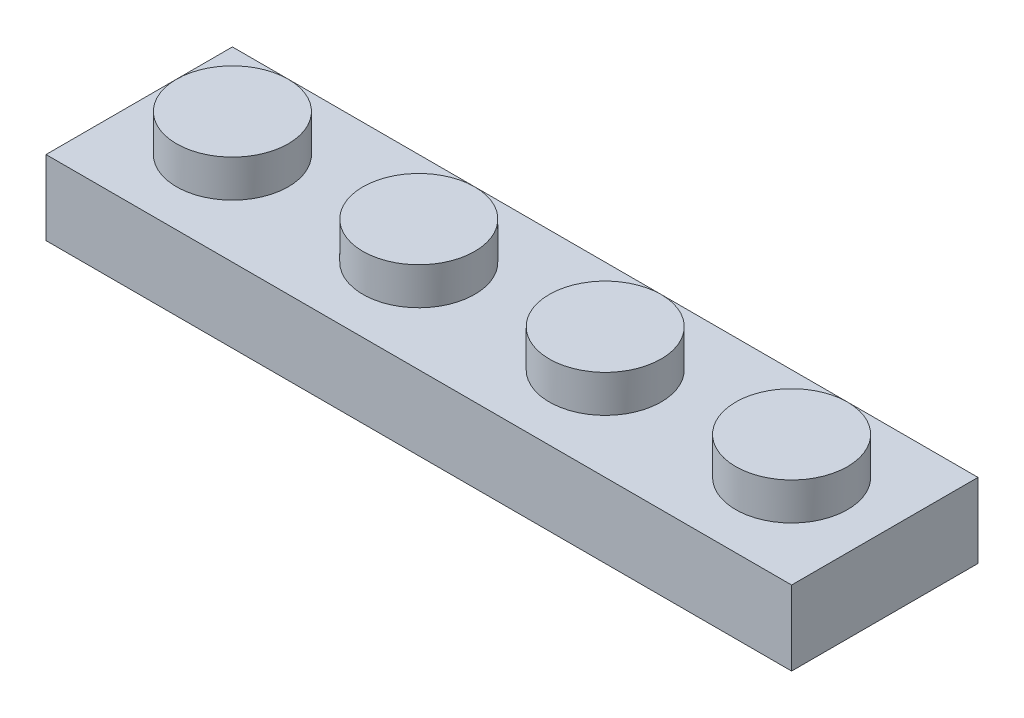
ISO-10303-21;
HEADER;
FILE_DESCRIPTION(('STEP AP214'),'2;1');
FILE_NAME('part.step','',(''),(''),'','','');
FILE_SCHEMA(('AUTOMOTIVE_DESIGN { 1 0 10303 214 1 1 1 1 }'));
ENDSEC;
DATA;
#1=APPLICATION_CONTEXT('core data for automotive mechanical design processes');
#2=APPLICATION_PROTOCOL_DEFINITION('international standard','automotive_design',2000,#1);
#3=PRODUCT_CONTEXT('',#1,'mechanical');
#4=PRODUCT('Part','Part','',(#3));
#5=PRODUCT_RELATED_PRODUCT_CATEGORY('part','',(#4));
#6=PRODUCT_DEFINITION_FORMATION('','',#4);
#7=PRODUCT_DEFINITION_CONTEXT('part definition',#1,'design');
#8=PRODUCT_DEFINITION('design','',#6,#7);
#9=PRODUCT_DEFINITION_SHAPE('','',#8);
#10=(LENGTH_UNIT() NAMED_UNIT(*) SI_UNIT(.MILLI.,.METRE.));
#11=(NAMED_UNIT(*) PLANE_ANGLE_UNIT() SI_UNIT($,.RADIAN.));
#12=(NAMED_UNIT(*) SI_UNIT($,.STERADIAN.) SOLID_ANGLE_UNIT());
#13=UNCERTAINTY_MEASURE_WITH_UNIT(LENGTH_MEASURE(1.E-05),#10,'distance_accuracy_value','');
#14=(GEOMETRIC_REPRESENTATION_CONTEXT(3) GLOBAL_UNCERTAINTY_ASSIGNED_CONTEXT((#13)) GLOBAL_UNIT_ASSIGNED_CONTEXT((#10,
#11,#12)) REPRESENTATION_CONTEXT('',''));
#15=CARTESIAN_POINT('',(0.,0.,0.));
#16=DIRECTION('',(0.,0.,1.));
#17=DIRECTION('',(1.,0.,0.));
#18=AXIS2_PLACEMENT_3D('',#15,#16,#17);
#19=CARTESIAN_POINT('',(0.,0.,0.));
#20=DIRECTION('',(0.,-1.,0.));
#21=DIRECTION('',(0.,0.,-1.));
#22=AXIS2_PLACEMENT_3D('',#19,#20,#21);
#23=PLANE('',#22);
#24=DIRECTION('',(0.,0.,-1.));
#25=VECTOR('',#24,1.);
#26=CARTESIAN_POINT('',(16.,0.,4.));
#27=LINE('',#26,#25);
#28=CARTESIAN_POINT('',(16.,0.,4.));
#29=VERTEX_POINT('',#28);
#30=CARTESIAN_POINT('',(16.,0.,-4.));
#31=VERTEX_POINT('',#30);
#32=EDGE_CURVE('E191',#29,#31,#27,.T.);
#33=ORIENTED_EDGE('',*,*,#32,.F.);
#34=DIRECTION('',(1.,0.,0.));
#35=VECTOR('',#34,1.);
#36=CARTESIAN_POINT('',(-16.,0.,4.));
#37=LINE('',#36,#35);
#38=CARTESIAN_POINT('',(-16.,0.,4.));
#39=VERTEX_POINT('',#38);
#40=EDGE_CURVE('E83',#39,#29,#37,.T.);
#41=ORIENTED_EDGE('',*,*,#40,.F.);
#42=DIRECTION('',(0.,0.,1.));
#43=VECTOR('',#42,1.);
#44=CARTESIAN_POINT('',(-16.,0.,4.));
#45=LINE('',#44,#43);
#46=CARTESIAN_POINT('',(-16.,0.,-4.));
#47=VERTEX_POINT('',#46);
#48=EDGE_CURVE('E203',#47,#39,#45,.T.);
#49=ORIENTED_EDGE('',*,*,#48,.F.);
#50=DIRECTION('',(-1.,0.,0.));
#51=VECTOR('',#50,1.);
#52=CARTESIAN_POINT('',(-16.,0.,-4.));
#53=LINE('',#52,#51);
#54=EDGE_CURVE('E201',#31,#47,#53,.T.);
#55=ORIENTED_EDGE('',*,*,#54,.F.);
#56=EDGE_LOOP('',(#33,#41,#49,#55));
#57=FACE_BOUND('',#56,.T.);
#58=DIRECTION('',(1.,0.,0.));
#59=VECTOR('',#58,1.);
#60=CARTESIAN_POINT('',(0.,0.,2.4));
#61=LINE('',#60,#59);
#62=CARTESIAN_POINT('',(-14.4,0.,2.4));
#63=VERTEX_POINT('',#62);
#64=CARTESIAN_POINT('',(14.4,0.,2.4));
#65=VERTEX_POINT('',#64);
#66=EDGE_CURVE('E131',#63,#65,#61,.T.);
#67=ORIENTED_EDGE('',*,*,#66,.T.);
#68=DIRECTION('',(0.,0.,-1.));
#69=VECTOR('',#68,1.);
#70=CARTESIAN_POINT('',(14.4,0.,0.));
#71=LINE('',#70,#69);
#72=CARTESIAN_POINT('',(14.4,0.,-2.4));
#73=VERTEX_POINT('',#72);
#74=EDGE_CURVE('E165',#65,#73,#71,.T.);
#75=ORIENTED_EDGE('',*,*,#74,.T.);
#76=DIRECTION('',(-1.,0.,0.));
#77=VECTOR('',#76,1.);
#78=CARTESIAN_POINT('',(0.,0.,-2.4));
#79=LINE('',#78,#77);
#80=CARTESIAN_POINT('',(-14.4,0.,-2.4));
#81=VERTEX_POINT('',#80);
#82=EDGE_CURVE('E135',#73,#81,#79,.T.);
#83=ORIENTED_EDGE('',*,*,#82,.T.);
#84=DIRECTION('',(0.,0.,1.));
#85=VECTOR('',#84,1.);
#86=CARTESIAN_POINT('',(-14.4,0.,0.));
#87=LINE('',#86,#85);
#88=EDGE_CURVE('E53',#81,#63,#87,.T.);
#89=ORIENTED_EDGE('',*,*,#88,.T.);
#90=EDGE_LOOP('',(#67,#75,#83,#89));
#91=FACE_BOUND('',#90,.T.);
#92=ADVANCED_FACE('F38',(#57,#91),#23,.T.);
#93=CARTESIAN_POINT('',(16.,3.2,4.));
#94=DIRECTION('',(-1.,0.,0.));
#95=DIRECTION('',(0.,0.,1.));
#96=AXIS2_PLACEMENT_3D('',#93,#94,#95);
#97=PLANE('',#96);
#98=ORIENTED_EDGE('',*,*,#32,.T.);
#99=DIRECTION('',(0.,-1.,0.));
#100=VECTOR('',#99,1.);
#101=CARTESIAN_POINT('',(16.,3.2,-4.));
#102=LINE('',#101,#100);
#103=CARTESIAN_POINT('',(16.,3.2,-4.));
#104=VERTEX_POINT('',#103);
#105=EDGE_CURVE('E212',#104,#31,#102,.T.);
#106=ORIENTED_EDGE('',*,*,#105,.F.);
#107=DIRECTION('',(0.,0.,-1.));
#108=VECTOR('',#107,1.);
#109=CARTESIAN_POINT('',(16.,3.2,4.));
#110=LINE('',#109,#108);
#111=CARTESIAN_POINT('',(16.,3.2,4.));
#112=VERTEX_POINT('',#111);
#113=EDGE_CURVE('E192',#112,#104,#110,.T.);
#114=ORIENTED_EDGE('',*,*,#113,.F.);
#115=DIRECTION('',(0.,-1.,0.));
#116=VECTOR('',#115,1.);
#117=CARTESIAN_POINT('',(16.,3.2,4.));
#118=LINE('',#117,#116);
#119=EDGE_CURVE('E198',#112,#29,#118,.T.);
#120=ORIENTED_EDGE('',*,*,#119,.T.);
#121=EDGE_LOOP('',(#98,#106,#114,#120));
#122=FACE_BOUND('',#121,.T.);
#123=ADVANCED_FACE('F40',(#122),#97,.F.);
#124=CARTESIAN_POINT('',(-16.,3.2,-4.));
#125=DIRECTION('',(0.,0.,1.));
#126=DIRECTION('',(1.,0.,0.));
#127=AXIS2_PLACEMENT_3D('',#124,#125,#126);
#128=PLANE('',#127);
#129=ORIENTED_EDGE('',*,*,#54,.T.);
#130=DIRECTION('',(0.,-1.,0.));
#131=VECTOR('',#130,1.);
#132=CARTESIAN_POINT('',(-16.,3.2,-4.));
#133=LINE('',#132,#131);
#134=CARTESIAN_POINT('',(-16.,3.2,-4.));
#135=VERTEX_POINT('',#134);
#136=EDGE_CURVE('E209',#135,#47,#133,.T.);
#137=ORIENTED_EDGE('',*,*,#136,.F.);
#138=DIRECTION('',(-1.,0.,0.));
#139=VECTOR('',#138,1.);
#140=CARTESIAN_POINT('',(-16.,3.2,-4.));
#141=LINE('',#140,#139);
#142=EDGE_CURVE('E91',#104,#135,#141,.T.);
#143=ORIENTED_EDGE('',*,*,#142,.F.);
#144=ORIENTED_EDGE('',*,*,#105,.T.);
#145=EDGE_LOOP('',(#129,#137,#143,#144));
#146=FACE_BOUND('',#145,.T.);
#147=ADVANCED_FACE('F238',(#146),#128,.F.);
#148=CARTESIAN_POINT('',(-16.,3.2,4.));
#149=DIRECTION('',(1.,0.,0.));
#150=DIRECTION('',(0.,0.,-1.));
#151=AXIS2_PLACEMENT_3D('',#148,#149,#150);
#152=PLANE('',#151);
#153=ORIENTED_EDGE('',*,*,#48,.T.);
#154=DIRECTION('',(0.,-1.,0.));
#155=VECTOR('',#154,1.);
#156=CARTESIAN_POINT('',(-16.,3.2,4.));
#157=LINE('',#156,#155);
#158=CARTESIAN_POINT('',(-16.,3.2,4.));
#159=VERTEX_POINT('',#158);
#160=EDGE_CURVE('E207',#159,#39,#157,.T.);
#161=ORIENTED_EDGE('',*,*,#160,.F.);
#162=DIRECTION('',(0.,0.,1.));
#163=VECTOR('',#162,1.);
#164=CARTESIAN_POINT('',(-16.,3.2,4.));
#165=LINE('',#164,#163);
#166=EDGE_CURVE('E195',#135,#159,#165,.T.);
#167=ORIENTED_EDGE('',*,*,#166,.F.);
#168=ORIENTED_EDGE('',*,*,#136,.T.);
#169=EDGE_LOOP('',(#153,#161,#167,#168));
#170=FACE_BOUND('',#169,.T.);
#171=ADVANCED_FACE('F243',(#170),#152,.F.);
#172=CARTESIAN_POINT('',(-16.,3.2,4.));
#173=DIRECTION('',(0.,0.,-1.));
#174=DIRECTION('',(-1.,0.,0.));
#175=AXIS2_PLACEMENT_3D('',#172,#173,#174);
#176=PLANE('',#175);
#177=ORIENTED_EDGE('',*,*,#40,.T.);
#178=ORIENTED_EDGE('',*,*,#119,.F.);
#179=DIRECTION('',(1.,0.,0.));
#180=VECTOR('',#179,1.);
#181=CARTESIAN_POINT('',(-16.,3.2,4.));
#182=LINE('',#181,#180);
#183=EDGE_CURVE('E62',#159,#112,#182,.T.);
#184=ORIENTED_EDGE('',*,*,#183,.F.);
#185=ORIENTED_EDGE('',*,*,#160,.T.);
#186=EDGE_LOOP('',(#177,#178,#184,#185));
#187=FACE_BOUND('',#186,.T.);
#188=ADVANCED_FACE('F228',(#187),#176,.F.);
#189=CARTESIAN_POINT('',(0.,3.2,0.));
#190=DIRECTION('',(0.,-1.,0.));
#191=DIRECTION('',(0.,0.,-1.));
#192=AXIS2_PLACEMENT_3D('',#189,#190,#191);
#193=PLANE('',#192);
#194=CARTESIAN_POINT('',(12.,3.2,0.));
#195=DIRECTION('',(0.,-1.,0.));
#196=DIRECTION('',(0.,0.,-1.));
#197=AXIS2_PLACEMENT_3D('',#194,#195,#196);
#198=CIRCLE('',#197,2.4);
#199=CARTESIAN_POINT('',(12.,3.2,-2.4));
#200=VERTEX_POINT('',#199);
#201=EDGE_CURVE('E11',#200,#200,#198,.F.);
#202=ORIENTED_EDGE('',*,*,#201,.F.);
#203=EDGE_LOOP('',(#202));
#204=FACE_BOUND('',#203,.T.);
#205=CARTESIAN_POINT('',(4.,3.2,0.));
#206=DIRECTION('',(0.,-1.,0.));
#207=DIRECTION('',(0.,0.,-1.));
#208=AXIS2_PLACEMENT_3D('',#205,#206,#207);
#209=CIRCLE('',#208,2.4);
#210=CARTESIAN_POINT('',(4.,3.2,-2.4));
#211=VERTEX_POINT('',#210);
#212=EDGE_CURVE('E46',#211,#211,#209,.F.);
#213=ORIENTED_EDGE('',*,*,#212,.F.);
#214=EDGE_LOOP('',(#213));
#215=FACE_BOUND('',#214,.T.);
#216=CARTESIAN_POINT('',(-4.,3.2,0.));
#217=DIRECTION('',(0.,-1.,0.));
#218=DIRECTION('',(0.,0.,-1.));
#219=AXIS2_PLACEMENT_3D('',#216,#217,#218);
#220=CIRCLE('',#219,2.4);
#221=CARTESIAN_POINT('',(-4.,3.2,-2.4));
#222=VERTEX_POINT('',#221);
#223=EDGE_CURVE('E217',#222,#222,#220,.F.);
#224=ORIENTED_EDGE('',*,*,#223,.F.);
#225=EDGE_LOOP('',(#224));
#226=FACE_BOUND('',#225,.T.);
#227=CARTESIAN_POINT('',(-12.,3.2,0.));
#228=DIRECTION('',(0.,-1.,0.));
#229=DIRECTION('',(0.,0.,-1.));
#230=AXIS2_PLACEMENT_3D('',#227,#228,#229);
#231=CIRCLE('',#230,2.4);
#232=CARTESIAN_POINT('',(-12.,3.2,-2.4));
#233=VERTEX_POINT('',#232);
#234=EDGE_CURVE('E214',#233,#233,#231,.F.);
#235=ORIENTED_EDGE('',*,*,#234,.F.);
#236=EDGE_LOOP('',(#235));
#237=FACE_BOUND('',#236,.T.);
#238=ORIENTED_EDGE('',*,*,#113,.T.);
#239=ORIENTED_EDGE('',*,*,#142,.T.);
#240=ORIENTED_EDGE('',*,*,#166,.T.);
#241=ORIENTED_EDGE('',*,*,#183,.T.);
#242=EDGE_LOOP('',(#238,#239,#240,#241));
#243=FACE_BOUND('',#242,.T.);
#244=ADVANCED_FACE('F224',(#204,#215,#226,#237,#243),#193,.F.);
#245=CARTESIAN_POINT('',(-12.,4.8,0.));
#246=DIRECTION('',(0.,-1.,0.));
#247=DIRECTION('',(0.,0.,-1.));
#248=AXIS2_PLACEMENT_3D('',#245,#246,#247);
#249=CYLINDRICAL_SURFACE('',#248,2.4);
#250=CARTESIAN_POINT('',(-12.,4.8,0.));
#251=DIRECTION('',(0.,1.,0.));
#252=DIRECTION('',(0.,0.,1.));
#253=AXIS2_PLACEMENT_3D('',#250,#251,#252);
#254=CIRCLE('',#253,2.4);
#255=CARTESIAN_POINT('',(-12.,4.8,2.4));
#256=VERTEX_POINT('',#255);
#257=EDGE_CURVE('E188',#256,#256,#254,.T.);
#258=ORIENTED_EDGE('',*,*,#257,.F.);
#259=EDGE_LOOP('',(#258));
#260=FACE_BOUND('',#259,.T.);
#261=ORIENTED_EDGE('',*,*,#234,.T.);
#262=EDGE_LOOP('',(#261));
#263=FACE_BOUND('',#262,.T.);
#264=ADVANCED_FACE('F227',(#260,#263),#249,.T.);
#265=CARTESIAN_POINT('',(-12.,4.8,0.));
#266=DIRECTION('',(0.,1.,0.));
#267=DIRECTION('',(0.,0.,1.));
#268=AXIS2_PLACEMENT_3D('',#265,#266,#267);
#269=PLANE('',#268);
#270=ORIENTED_EDGE('',*,*,#257,.T.);
#271=EDGE_LOOP('',(#270));
#272=FACE_BOUND('',#271,.T.);
#273=ADVANCED_FACE('F321',(#272),#269,.T.);
#274=CARTESIAN_POINT('',(-4.,4.8,0.));
#275=DIRECTION('',(0.,-1.,0.));
#276=DIRECTION('',(0.,0.,-1.));
#277=AXIS2_PLACEMENT_3D('',#274,#275,#276);
#278=CYLINDRICAL_SURFACE('',#277,2.4);
#279=CARTESIAN_POINT('',(-4.,4.8,0.));
#280=DIRECTION('',(0.,1.,0.));
#281=DIRECTION('',(0.,0.,1.));
#282=AXIS2_PLACEMENT_3D('',#279,#280,#281);
#283=CIRCLE('',#282,2.4);
#284=CARTESIAN_POINT('',(-4.,4.8,2.4));
#285=VERTEX_POINT('',#284);
#286=EDGE_CURVE('E185',#285,#285,#283,.T.);
#287=ORIENTED_EDGE('',*,*,#286,.F.);
#288=EDGE_LOOP('',(#287));
#289=FACE_BOUND('',#288,.T.);
#290=ORIENTED_EDGE('',*,*,#223,.T.);
#291=EDGE_LOOP('',(#290));
#292=FACE_BOUND('',#291,.T.);
#293=ADVANCED_FACE('F317',(#289,#292),#278,.T.);
#294=CARTESIAN_POINT('',(-4.,4.8,0.));
#295=DIRECTION('',(0.,1.,0.));
#296=DIRECTION('',(0.,0.,1.));
#297=AXIS2_PLACEMENT_3D('',#294,#295,#296);
#298=PLANE('',#297);
#299=ORIENTED_EDGE('',*,*,#286,.T.);
#300=EDGE_LOOP('',(#299));
#301=FACE_BOUND('',#300,.T.);
#302=ADVANCED_FACE('F313',(#301),#298,.T.);
#303=CARTESIAN_POINT('',(4.,4.8,0.));
#304=DIRECTION('',(0.,-1.,0.));
#305=DIRECTION('',(0.,0.,-1.));
#306=AXIS2_PLACEMENT_3D('',#303,#304,#305);
#307=CYLINDRICAL_SURFACE('',#306,2.4);
#308=CARTESIAN_POINT('',(4.,4.8,0.));
#309=DIRECTION('',(0.,1.,0.));
#310=DIRECTION('',(0.,0.,1.));
#311=AXIS2_PLACEMENT_3D('',#308,#309,#310);
#312=CIRCLE('',#311,2.4);
#313=CARTESIAN_POINT('',(4.,4.8,2.4));
#314=VERTEX_POINT('',#313);
#315=EDGE_CURVE('E182',#314,#314,#312,.T.);
#316=ORIENTED_EDGE('',*,*,#315,.F.);
#317=EDGE_LOOP('',(#316));
#318=FACE_BOUND('',#317,.T.);
#319=ORIENTED_EDGE('',*,*,#212,.T.);
#320=EDGE_LOOP('',(#319));
#321=FACE_BOUND('',#320,.T.);
#322=ADVANCED_FACE('F222',(#318,#321),#307,.T.);
#323=CARTESIAN_POINT('',(4.,4.8,0.));
#324=DIRECTION('',(0.,1.,0.));
#325=DIRECTION('',(0.,0.,1.));
#326=AXIS2_PLACEMENT_3D('',#323,#324,#325);
#327=PLANE('',#326);
#328=ORIENTED_EDGE('',*,*,#315,.T.);
#329=EDGE_LOOP('',(#328));
#330=FACE_BOUND('',#329,.T.);
#331=ADVANCED_FACE('F306',(#330),#327,.T.);
#332=CARTESIAN_POINT('',(12.,4.8,0.));
#333=DIRECTION('',(0.,-1.,0.));
#334=DIRECTION('',(0.,0.,-1.));
#335=AXIS2_PLACEMENT_3D('',#332,#333,#334);
#336=CYLINDRICAL_SURFACE('',#335,2.4);
#337=CARTESIAN_POINT('',(12.,4.8,0.));
#338=DIRECTION('',(0.,1.,0.));
#339=DIRECTION('',(0.,0.,1.));
#340=AXIS2_PLACEMENT_3D('',#337,#338,#339);
#341=CIRCLE('',#340,2.4);
#342=CARTESIAN_POINT('',(12.,4.8,2.4));
#343=VERTEX_POINT('',#342);
#344=EDGE_CURVE('E156',#343,#343,#341,.T.);
#345=ORIENTED_EDGE('',*,*,#344,.F.);
#346=EDGE_LOOP('',(#345));
#347=FACE_BOUND('',#346,.T.);
#348=ORIENTED_EDGE('',*,*,#201,.T.);
#349=EDGE_LOOP('',(#348));
#350=FACE_BOUND('',#349,.T.);
#351=ADVANCED_FACE('F302',(#347,#350),#336,.T.);
#352=CARTESIAN_POINT('',(12.,4.8,0.));
#353=DIRECTION('',(0.,1.,0.));
#354=DIRECTION('',(0.,0.,1.));
#355=AXIS2_PLACEMENT_3D('',#352,#353,#354);
#356=PLANE('',#355);
#357=ORIENTED_EDGE('',*,*,#344,.T.);
#358=EDGE_LOOP('',(#357));
#359=FACE_BOUND('',#358,.T.);
#360=ADVANCED_FACE('F299',(#359),#356,.T.);
#361=CARTESIAN_POINT('',(14.4,3.2,4.));
#362=DIRECTION('',(-1.,0.,0.));
#363=DIRECTION('',(0.,0.,1.));
#364=AXIS2_PLACEMENT_3D('',#361,#362,#363);
#365=PLANE('',#364);
#366=ORIENTED_EDGE('',*,*,#74,.F.);
#367=DIRECTION('',(0.,-1.,0.));
#368=VECTOR('',#367,1.);
#369=CARTESIAN_POINT('',(14.4,3.2,2.4));
#370=LINE('',#369,#368);
#371=CARTESIAN_POINT('',(14.4,1.6,2.4));
#372=VERTEX_POINT('',#371);
#373=EDGE_CURVE('E130',#372,#65,#370,.T.);
#374=ORIENTED_EDGE('',*,*,#373,.F.);
#375=DIRECTION('',(0.,0.,-1.));
#376=VECTOR('',#375,1.);
#377=CARTESIAN_POINT('',(14.4,1.6,0.));
#378=LINE('',#377,#376);
#379=CARTESIAN_POINT('',(14.4,1.6,-2.4));
#380=VERTEX_POINT('',#379);
#381=EDGE_CURVE('E118',#372,#380,#378,.T.);
#382=ORIENTED_EDGE('',*,*,#381,.T.);
#383=DIRECTION('',(0.,-1.,0.));
#384=VECTOR('',#383,1.);
#385=CARTESIAN_POINT('',(14.4,3.2,-2.4));
#386=LINE('',#385,#384);
#387=EDGE_CURVE('E128',#380,#73,#386,.T.);
#388=ORIENTED_EDGE('',*,*,#387,.T.);
#389=EDGE_LOOP('',(#366,#374,#382,#388));
#390=FACE_BOUND('',#389,.T.);
#391=ADVANCED_FACE('F127',(#390),#365,.T.);
#392=CARTESIAN_POINT('',(-16.,3.2,-2.4));
#393=DIRECTION('',(0.,0.,1.));
#394=DIRECTION('',(1.,0.,0.));
#395=AXIS2_PLACEMENT_3D('',#392,#393,#394);
#396=PLANE('',#395);
#397=ORIENTED_EDGE('',*,*,#82,.F.);
#398=ORIENTED_EDGE('',*,*,#387,.F.);
#399=DIRECTION('',(-1.,0.,0.));
#400=VECTOR('',#399,1.);
#401=CARTESIAN_POINT('',(0.,1.6,-2.4));
#402=LINE('',#401,#400);
#403=CARTESIAN_POINT('',(-14.4,1.6,-2.4));
#404=VERTEX_POINT('',#403);
#405=EDGE_CURVE('E114',#380,#404,#402,.T.);
#406=ORIENTED_EDGE('',*,*,#405,.T.);
#407=DIRECTION('',(0.,-1.,0.));
#408=VECTOR('',#407,1.);
#409=CARTESIAN_POINT('',(-14.4,3.2,-2.4));
#410=LINE('',#409,#408);
#411=EDGE_CURVE('E137',#404,#81,#410,.T.);
#412=ORIENTED_EDGE('',*,*,#411,.T.);
#413=EDGE_LOOP('',(#397,#398,#406,#412));
#414=FACE_BOUND('',#413,.T.);
#415=ADVANCED_FACE('F133',(#414),#396,.T.);
#416=CARTESIAN_POINT('',(-14.4,3.2,4.));
#417=DIRECTION('',(1.,0.,0.));
#418=DIRECTION('',(0.,0.,-1.));
#419=AXIS2_PLACEMENT_3D('',#416,#417,#418);
#420=PLANE('',#419);
#421=ORIENTED_EDGE('',*,*,#88,.F.);
#422=ORIENTED_EDGE('',*,*,#411,.F.);
#423=DIRECTION('',(0.,0.,1.));
#424=VECTOR('',#423,1.);
#425=CARTESIAN_POINT('',(-14.4,1.6,0.));
#426=LINE('',#425,#424);
#427=CARTESIAN_POINT('',(-14.4,1.6,2.4));
#428=VERTEX_POINT('',#427);
#429=EDGE_CURVE('E119',#404,#428,#426,.T.);
#430=ORIENTED_EDGE('',*,*,#429,.T.);
#431=DIRECTION('',(0.,-1.,0.));
#432=VECTOR('',#431,1.);
#433=CARTESIAN_POINT('',(-14.4,3.2,2.4));
#434=LINE('',#433,#432);
#435=EDGE_CURVE('E142',#428,#63,#434,.T.);
#436=ORIENTED_EDGE('',*,*,#435,.T.);
#437=EDGE_LOOP('',(#421,#422,#430,#436));
#438=FACE_BOUND('',#437,.T.);
#439=ADVANCED_FACE('F252',(#438),#420,.T.);
#440=CARTESIAN_POINT('',(-16.,3.2,2.4));
#441=DIRECTION('',(0.,0.,-1.));
#442=DIRECTION('',(-1.,0.,0.));
#443=AXIS2_PLACEMENT_3D('',#440,#441,#442);
#444=PLANE('',#443);
#445=ORIENTED_EDGE('',*,*,#66,.F.);
#446=ORIENTED_EDGE('',*,*,#435,.F.);
#447=DIRECTION('',(1.,0.,0.));
#448=VECTOR('',#447,1.);
#449=CARTESIAN_POINT('',(0.,1.6,2.4));
#450=LINE('',#449,#448);
#451=EDGE_CURVE('E148',#428,#372,#450,.T.);
#452=ORIENTED_EDGE('',*,*,#451,.T.);
#453=ORIENTED_EDGE('',*,*,#373,.T.);
#454=EDGE_LOOP('',(#445,#446,#452,#453));
#455=FACE_BOUND('',#454,.T.);
#456=ADVANCED_FACE('F251',(#455),#444,.T.);
#457=CARTESIAN_POINT('',(0.,1.6,0.));
#458=DIRECTION('',(0.,-1.,0.));
#459=DIRECTION('',(0.,0.,-1.));
#460=AXIS2_PLACEMENT_3D('',#457,#458,#459);
#461=PLANE('',#460);
#462=CARTESIAN_POINT('',(8.,1.6,0.));
#463=DIRECTION('',(0.,-1.,0.));
#464=DIRECTION('',(0.,0.,-1.));
#465=AXIS2_PLACEMENT_3D('',#462,#463,#464);
#466=CIRCLE('',#465,1.77);
#467=CARTESIAN_POINT('',(8.,1.6,1.77));
#468=VERTEX_POINT('',#467);
#469=EDGE_CURVE('E490',#468,#468,#466,.T.);
#470=ORIENTED_EDGE('',*,*,#469,.F.);
#471=EDGE_LOOP('',(#470));
#472=FACE_BOUND('',#471,.T.);
#473=CARTESIAN_POINT('',(0.,1.6,0.));
#474=DIRECTION('',(0.,-1.,0.));
#475=DIRECTION('',(0.,0.,-1.));
#476=AXIS2_PLACEMENT_3D('',#473,#474,#475);
#477=CIRCLE('',#476,1.77);
#478=CARTESIAN_POINT('',(0.,1.6,-1.77));
#479=VERTEX_POINT('',#478);
#480=EDGE_CURVE('E489',#479,#479,#477,.T.);
#481=ORIENTED_EDGE('',*,*,#480,.F.);
#482=EDGE_LOOP('',(#481));
#483=FACE_BOUND('',#482,.T.);
#484=CARTESIAN_POINT('',(-8.,1.6,0.));
#485=DIRECTION('',(0.,-1.,0.));
#486=DIRECTION('',(0.,0.,-1.));
#487=AXIS2_PLACEMENT_3D('',#484,#485,#486);
#488=CIRCLE('',#487,1.77);
#489=CARTESIAN_POINT('',(-8.,1.6,1.77));
#490=VERTEX_POINT('',#489);
#491=EDGE_CURVE('E499',#490,#490,#488,.T.);
#492=ORIENTED_EDGE('',*,*,#491,.F.);
#493=EDGE_LOOP('',(#492));
#494=FACE_BOUND('',#493,.T.);
#495=CARTESIAN_POINT('',(12.,1.6,0.));
#496=DIRECTION('',(0.,-1.,0.));
#497=DIRECTION('',(0.,0.,-1.));
#498=AXIS2_PLACEMENT_3D('',#495,#496,#497);
#499=CIRCLE('',#498,0.800000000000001);
#500=CARTESIAN_POINT('',(12.,1.6,-0.800000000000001));
#501=VERTEX_POINT('',#500);
#502=EDGE_CURVE('E153',#501,#501,#499,.F.);
#503=ORIENTED_EDGE('',*,*,#502,.T.);
#504=EDGE_LOOP('',(#503));
#505=FACE_BOUND('',#504,.T.);
#506=CARTESIAN_POINT('',(4.,1.6,0.));
#507=DIRECTION('',(0.,-1.,0.));
#508=DIRECTION('',(0.,0.,-1.));
#509=AXIS2_PLACEMENT_3D('',#506,#507,#508);
#510=CIRCLE('',#509,0.800000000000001);
#511=CARTESIAN_POINT('',(4.,1.6,-0.800000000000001));
#512=VERTEX_POINT('',#511);
#513=EDGE_CURVE('E157',#512,#512,#510,.F.);
#514=ORIENTED_EDGE('',*,*,#513,.T.);
#515=EDGE_LOOP('',(#514));
#516=FACE_BOUND('',#515,.T.);
#517=CARTESIAN_POINT('',(-4.,1.6,0.));
#518=DIRECTION('',(0.,-1.,0.));
#519=DIRECTION('',(0.,0.,-1.));
#520=AXIS2_PLACEMENT_3D('',#517,#518,#519);
#521=CIRCLE('',#520,0.800000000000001);
#522=CARTESIAN_POINT('',(-4.,1.6,-0.800000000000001));
#523=VERTEX_POINT('',#522);
#524=EDGE_CURVE('E140',#523,#523,#521,.F.);
#525=ORIENTED_EDGE('',*,*,#524,.T.);
#526=EDGE_LOOP('',(#525));
#527=FACE_BOUND('',#526,.T.);
#528=CARTESIAN_POINT('',(-12.,1.6,0.));
#529=DIRECTION('',(0.,-1.,0.));
#530=DIRECTION('',(0.,0.,-1.));
#531=AXIS2_PLACEMENT_3D('',#528,#529,#530);
#532=CIRCLE('',#531,0.800000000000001);
#533=CARTESIAN_POINT('',(-12.,1.6,-0.800000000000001));
#534=VERTEX_POINT('',#533);
#535=EDGE_CURVE('E136',#534,#534,#532,.F.);
#536=ORIENTED_EDGE('',*,*,#535,.T.);
#537=EDGE_LOOP('',(#536));
#538=FACE_BOUND('',#537,.T.);
#539=ORIENTED_EDGE('',*,*,#381,.F.);
#540=ORIENTED_EDGE('',*,*,#451,.F.);
#541=ORIENTED_EDGE('',*,*,#429,.F.);
#542=ORIENTED_EDGE('',*,*,#405,.F.);
#543=EDGE_LOOP('',(#539,#540,#541,#542));
#544=FACE_BOUND('',#543,.T.);
#545=ADVANCED_FACE('F116',(#472,#483,#494,#505,#516,#527,#538,#544),#461,.T.);
#546=CARTESIAN_POINT('',(-12.,4.8,0.));
#547=DIRECTION('',(0.,-1.,0.));
#548=DIRECTION('',(0.,0.,-1.));
#549=AXIS2_PLACEMENT_3D('',#546,#547,#548);
#550=CYLINDRICAL_SURFACE('',#549,0.800000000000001);
#551=CARTESIAN_POINT('',(-12.,3.2,0.));
#552=DIRECTION('',(0.,1.,0.));
#553=DIRECTION('',(0.,0.,1.));
#554=AXIS2_PLACEMENT_3D('',#551,#552,#553);
#555=CIRCLE('',#554,0.800000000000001);
#556=CARTESIAN_POINT('',(-12.,3.2,0.800000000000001));
#557=VERTEX_POINT('',#556);
#558=EDGE_CURVE('E162',#557,#557,#555,.T.);
#559=ORIENTED_EDGE('',*,*,#558,.T.);
#560=EDGE_LOOP('',(#559));
#561=FACE_BOUND('',#560,.T.);
#562=ORIENTED_EDGE('',*,*,#535,.F.);
#563=EDGE_LOOP('',(#562));
#564=FACE_BOUND('',#563,.T.);
#565=ADVANCED_FACE('F265',(#561,#564),#550,.F.);
#566=CARTESIAN_POINT('',(-12.,3.2,0.));
#567=DIRECTION('',(0.,1.,0.));
#568=DIRECTION('',(0.,0.,1.));
#569=AXIS2_PLACEMENT_3D('',#566,#567,#568);
#570=PLANE('',#569);
#571=ORIENTED_EDGE('',*,*,#558,.F.);
#572=EDGE_LOOP('',(#571));
#573=FACE_BOUND('',#572,.T.);
#574=ADVANCED_FACE('F269',(#573),#570,.F.);
#575=CARTESIAN_POINT('',(-4.,4.8,0.));
#576=DIRECTION('',(0.,-1.,0.));
#577=DIRECTION('',(0.,0.,-1.));
#578=AXIS2_PLACEMENT_3D('',#575,#576,#577);
#579=CYLINDRICAL_SURFACE('',#578,0.800000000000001);
#580=CARTESIAN_POINT('',(-4.,3.2,0.));
#581=DIRECTION('',(0.,1.,0.));
#582=DIRECTION('',(0.,0.,1.));
#583=AXIS2_PLACEMENT_3D('',#580,#581,#582);
#584=CIRCLE('',#583,0.800000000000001);
#585=CARTESIAN_POINT('',(-4.,3.2,0.800000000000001));
#586=VERTEX_POINT('',#585);
#587=EDGE_CURVE('E166',#586,#586,#584,.T.);
#588=ORIENTED_EDGE('',*,*,#587,.T.);
#589=EDGE_LOOP('',(#588));
#590=FACE_BOUND('',#589,.T.);
#591=ORIENTED_EDGE('',*,*,#524,.F.);
#592=EDGE_LOOP('',(#591));
#593=FACE_BOUND('',#592,.T.);
#594=ADVANCED_FACE('F273',(#590,#593),#579,.F.);
#595=CARTESIAN_POINT('',(-4.,3.2,0.));
#596=DIRECTION('',(0.,1.,0.));
#597=DIRECTION('',(0.,0.,1.));
#598=AXIS2_PLACEMENT_3D('',#595,#596,#597);
#599=PLANE('',#598);
#600=ORIENTED_EDGE('',*,*,#587,.F.);
#601=EDGE_LOOP('',(#600));
#602=FACE_BOUND('',#601,.T.);
#603=ADVANCED_FACE('F277',(#602),#599,.F.);
#604=CARTESIAN_POINT('',(4.,4.8,0.));
#605=DIRECTION('',(0.,-1.,0.));
#606=DIRECTION('',(0.,0.,-1.));
#607=AXIS2_PLACEMENT_3D('',#604,#605,#606);
#608=CYLINDRICAL_SURFACE('',#607,0.800000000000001);
#609=CARTESIAN_POINT('',(4.,3.2,0.));
#610=DIRECTION('',(0.,1.,0.));
#611=DIRECTION('',(0.,0.,1.));
#612=AXIS2_PLACEMENT_3D('',#609,#610,#611);
#613=CIRCLE('',#612,0.800000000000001);
#614=CARTESIAN_POINT('',(4.,3.2,0.800000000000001));
#615=VERTEX_POINT('',#614);
#616=EDGE_CURVE('E169',#615,#615,#613,.T.);
#617=ORIENTED_EDGE('',*,*,#616,.T.);
#618=EDGE_LOOP('',(#617));
#619=FACE_BOUND('',#618,.T.);
#620=ORIENTED_EDGE('',*,*,#513,.F.);
#621=EDGE_LOOP('',(#620));
#622=FACE_BOUND('',#621,.T.);
#623=ADVANCED_FACE('F281',(#619,#622),#608,.F.);
#624=CARTESIAN_POINT('',(4.,3.2,0.));
#625=DIRECTION('',(0.,1.,0.));
#626=DIRECTION('',(0.,0.,1.));
#627=AXIS2_PLACEMENT_3D('',#624,#625,#626);
#628=PLANE('',#627);
#629=ORIENTED_EDGE('',*,*,#616,.F.);
#630=EDGE_LOOP('',(#629));
#631=FACE_BOUND('',#630,.T.);
#632=ADVANCED_FACE('F285',(#631),#628,.F.);
#633=CARTESIAN_POINT('',(12.,4.8,0.));
#634=DIRECTION('',(0.,-1.,0.));
#635=DIRECTION('',(0.,0.,-1.));
#636=AXIS2_PLACEMENT_3D('',#633,#634,#635);
#637=CYLINDRICAL_SURFACE('',#636,0.800000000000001);
#638=CARTESIAN_POINT('',(12.,3.2,0.));
#639=DIRECTION('',(0.,1.,0.));
#640=DIRECTION('',(0.,0.,1.));
#641=AXIS2_PLACEMENT_3D('',#638,#639,#640);
#642=CIRCLE('',#641,0.800000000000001);
#643=CARTESIAN_POINT('',(12.,3.2,0.800000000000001));
#644=VERTEX_POINT('',#643);
#645=EDGE_CURVE('E172',#644,#644,#642,.T.);
#646=ORIENTED_EDGE('',*,*,#645,.T.);
#647=EDGE_LOOP('',(#646));
#648=FACE_BOUND('',#647,.T.);
#649=ORIENTED_EDGE('',*,*,#502,.F.);
#650=EDGE_LOOP('',(#649));
#651=FACE_BOUND('',#650,.T.);
#652=ADVANCED_FACE('F289',(#648,#651),#637,.F.);
#653=CARTESIAN_POINT('',(12.,3.2,0.));
#654=DIRECTION('',(0.,1.,0.));
#655=DIRECTION('',(0.,0.,1.));
#656=AXIS2_PLACEMENT_3D('',#653,#654,#655);
#657=PLANE('',#656);
#658=ORIENTED_EDGE('',*,*,#645,.F.);
#659=EDGE_LOOP('',(#658));
#660=FACE_BOUND('',#659,.T.);
#661=ADVANCED_FACE('F293',(#660),#657,.F.);
#662=CARTESIAN_POINT('',(-8.,-5.00631601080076,0.));
#663=DIRECTION('',(0.,1.,0.));
#664=DIRECTION('',(0.,0.,1.));
#665=AXIS2_PLACEMENT_3D('',#662,#663,#664);
#666=CYLINDRICAL_SURFACE('',#665,1.77);
#667=CARTESIAN_POINT('',(-8.,0.,0.));
#668=DIRECTION('',(0.,-1.,0.));
#669=DIRECTION('',(0.,0.,-1.));
#670=AXIS2_PLACEMENT_3D('',#667,#668,#669);
#671=CIRCLE('',#670,1.77);
#672=CARTESIAN_POINT('',(-8.,0.,1.77));
#673=VERTEX_POINT('',#672);
#674=EDGE_CURVE('E145',#673,#673,#671,.T.);
#675=CARTESIAN_POINT('',(-8.,1.6,1.77));
#676=CARTESIAN_POINT('',(-8.,1.58333333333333,1.77));
#677=CARTESIAN_POINT('',(-8.,1.56666666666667,1.77));
#678=CARTESIAN_POINT('',(-8.,1.53333333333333,1.77));
#679=CARTESIAN_POINT('',(-8.,1.51666666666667,1.77));
#680=CARTESIAN_POINT('',(-8.,1.48333333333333,1.77));
#681=CARTESIAN_POINT('',(-8.,1.46666666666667,1.77));
#682=CARTESIAN_POINT('',(-8.,1.43333333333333,1.77));
#683=CARTESIAN_POINT('',(-8.,1.41666666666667,1.77));
#684=CARTESIAN_POINT('',(-8.,1.38333333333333,1.77));
#685=CARTESIAN_POINT('',(-8.,1.36666666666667,1.77));
#686=CARTESIAN_POINT('',(-8.,1.33333333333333,1.77));
#687=CARTESIAN_POINT('',(-8.,1.31666666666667,1.77));
#688=CARTESIAN_POINT('',(-8.,1.28333333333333,1.77));
#689=CARTESIAN_POINT('',(-8.,1.26666666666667,1.77));
#690=CARTESIAN_POINT('',(-8.,1.23333333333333,1.77));
#691=CARTESIAN_POINT('',(-8.,1.21666666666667,1.77));
#692=CARTESIAN_POINT('',(-8.,1.18333333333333,1.77));
#693=CARTESIAN_POINT('',(-8.,1.16666666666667,1.77));
#694=CARTESIAN_POINT('',(-8.,1.13333333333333,1.77));
#695=CARTESIAN_POINT('',(-8.,1.11666666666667,1.77));
#696=CARTESIAN_POINT('',(-8.,1.08333333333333,1.77));
#697=CARTESIAN_POINT('',(-8.,1.06666666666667,1.77));
#698=CARTESIAN_POINT('',(-8.,1.03333333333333,1.77));
#699=CARTESIAN_POINT('',(-8.,1.01666666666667,1.77));
#700=CARTESIAN_POINT('',(-8.,0.983333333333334,1.77));
#701=CARTESIAN_POINT('',(-8.,0.966666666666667,1.77));
#702=CARTESIAN_POINT('',(-8.,0.933333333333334,1.77));
#703=CARTESIAN_POINT('',(-8.,0.916666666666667,1.77));
#704=CARTESIAN_POINT('',(-8.,0.883333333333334,1.77));
#705=CARTESIAN_POINT('',(-8.,0.866666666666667,1.77));
#706=CARTESIAN_POINT('',(-8.,0.833333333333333,1.77));
#707=CARTESIAN_POINT('',(-8.,0.816666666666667,1.77));
#708=CARTESIAN_POINT('',(-8.,0.783333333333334,1.77));
#709=CARTESIAN_POINT('',(-8.,0.766666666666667,1.77));
#710=CARTESIAN_POINT('',(-8.,0.733333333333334,1.77));
#711=CARTESIAN_POINT('',(-8.,0.716666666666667,1.77));
#712=CARTESIAN_POINT('',(-8.,0.683333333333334,1.77));
#713=CARTESIAN_POINT('',(-8.,0.666666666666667,1.77));
#714=CARTESIAN_POINT('',(-8.,0.633333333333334,1.77));
#715=CARTESIAN_POINT('',(-8.,0.616666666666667,1.77));
#716=CARTESIAN_POINT('',(-8.,0.583333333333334,1.77));
#717=CARTESIAN_POINT('',(-8.,0.566666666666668,1.77));
#718=CARTESIAN_POINT('',(-8.,0.533333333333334,1.77));
#719=CARTESIAN_POINT('',(-8.,0.516666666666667,1.77));
#720=CARTESIAN_POINT('',(-8.,0.483333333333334,1.77));
#721=CARTESIAN_POINT('',(-8.,0.466666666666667,1.77));
#722=CARTESIAN_POINT('',(-8.,0.433333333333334,1.77));
#723=CARTESIAN_POINT('',(-8.,0.416666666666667,1.77));
#724=CARTESIAN_POINT('',(-8.,0.383333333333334,1.77));
#725=CARTESIAN_POINT('',(-8.,0.366666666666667,1.77));
#726=CARTESIAN_POINT('',(-8.,0.333333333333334,1.77));
#727=CARTESIAN_POINT('',(-8.,0.316666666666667,1.77));
#728=CARTESIAN_POINT('',(-8.,0.283333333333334,1.77));
#729=CARTESIAN_POINT('',(-8.,0.266666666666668,1.77));
#730=CARTESIAN_POINT('',(-8.,0.233333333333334,1.77));
#731=CARTESIAN_POINT('',(-8.,0.216666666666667,1.77));
#732=CARTESIAN_POINT('',(-8.,0.183333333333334,1.77));
#733=CARTESIAN_POINT('',(-8.,0.166666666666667,1.77));
#734=CARTESIAN_POINT('',(-8.,0.133333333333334,1.77));
#735=CARTESIAN_POINT('',(-8.,0.116666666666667,1.77));
#736=CARTESIAN_POINT('',(-8.,0.0833333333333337,1.77));
#737=CARTESIAN_POINT('',(-8.,0.0666666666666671,1.77));
#738=CARTESIAN_POINT('',(-8.,0.033333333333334,1.77));
#739=CARTESIAN_POINT('',(-8.,0.0166666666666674,1.77));
#740=CARTESIAN_POINT('',(-8.,0.,1.77));
#741=B_SPLINE_CURVE_WITH_KNOTS('',3,(#675,#676,#677,#678,#679,#680,#681,#682,#683,#684,#685,
#686,#687,#688,#689,#690,#691,#692,#693,#694,#695,#696,#697,#698,#699,#700,#701,#702,#703,#704,
#705,#706,#707,#708,#709,#710,#711,#712,#713,#714,#715,#716,#717,#718,#719,#720,#721,#722,#723,
#724,#725,#726,#727,#728,#729,#730,#731,#732,#733,#734,#735,#736,#737,#738,#739,#740),
.UNSPECIFIED.,.F.,.F.,(4,2,2,2,2,2,2,2,2,2,2,2,2,2,2,2,2,2,2,2,2,2,2,2,2,2,2,2,2,2,2,2,4),(0.,
0.0499999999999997,0.1,0.15,0.2,0.25,0.3,0.35,0.399999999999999,0.45,0.5,0.55,0.6,0.65,
0.699999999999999,0.75,0.799999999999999,0.849999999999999,0.9,0.95,0.999999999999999,1.05,1.1,
1.15,1.2,1.25,1.3,1.35,1.4,1.45,1.5,1.55,1.6),.UNSPECIFIED.);
#742=EDGE_CURVE('BSEAM297',#490,#673,#741,.T.);
#743=ORIENTED_EDGE('',*,*,#491,.T.);
#744=ORIENTED_EDGE('',*,*,#674,.F.);
#745=ORIENTED_EDGE('',*,*,#742,.T.);
#746=ORIENTED_EDGE('',*,*,#742,.F.);
#747=EDGE_LOOP('',(#743,#745,#744,#746));
#748=FACE_BOUND('',#747,.T.);
#749=ADVANCED_FACE('F297',(#748),#666,.T.);
#750=CARTESIAN_POINT('',(0.,0.,0.));
#751=DIRECTION('',(0.,-1.,0.));
#752=DIRECTION('',(0.,0.,-1.));
#753=AXIS2_PLACEMENT_3D('',#750,#751,#752);
#754=PLANE('',#753);
#755=ORIENTED_EDGE('',*,*,#674,.T.);
#756=EDGE_LOOP('',(#755));
#757=FACE_BOUND('',#756,.T.);
#758=ADVANCED_FACE('F427',(#757),#754,.T.);
#759=CARTESIAN_POINT('',(0.,-5.00631601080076,0.));
#760=DIRECTION('',(0.,1.,0.));
#761=DIRECTION('',(0.,0.,1.));
#762=AXIS2_PLACEMENT_3D('',#759,#760,#761);
#763=CYLINDRICAL_SURFACE('',#762,1.77);
#764=ORIENTED_EDGE('',*,*,#480,.T.);
#765=EDGE_LOOP('',(#764));
#766=FACE_BOUND('',#765,.T.);
#767=CARTESIAN_POINT('',(0.,0.,0.));
#768=DIRECTION('',(0.,-1.,0.));
#769=DIRECTION('',(0.,0.,-1.));
#770=AXIS2_PLACEMENT_3D('',#767,#768,#769);
#771=CIRCLE('',#770,1.77);
#772=CARTESIAN_POINT('',(0.,0.,-1.77));
#773=VERTEX_POINT('',#772);
#774=EDGE_CURVE('E493',#773,#773,#771,.T.);
#775=ORIENTED_EDGE('',*,*,#774,.F.);
#776=EDGE_LOOP('',(#775));
#777=FACE_BOUND('',#776,.T.);
#778=ADVANCED_FACE('F437',(#766,#777),#763,.T.);
#779=CARTESIAN_POINT('',(0.,0.,0.));
#780=DIRECTION('',(0.,-1.,0.));
#781=DIRECTION('',(0.,0.,-1.));
#782=AXIS2_PLACEMENT_3D('',#779,#780,#781);
#783=PLANE('',#782);
#784=ORIENTED_EDGE('',*,*,#774,.T.);
#785=EDGE_LOOP('',(#784));
#786=FACE_BOUND('',#785,.T.);
#787=ADVANCED_FACE('F451',(#786),#783,.T.);
#788=CARTESIAN_POINT('',(8.,-5.00631601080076,0.));
#789=DIRECTION('',(0.,1.,0.));
#790=DIRECTION('',(0.,0.,1.));
#791=AXIS2_PLACEMENT_3D('',#788,#789,#790);
#792=CYLINDRICAL_SURFACE('',#791,1.77);
#793=CARTESIAN_POINT('',(8.,0.,0.));
#794=DIRECTION('',(0.,-1.,0.));
#795=DIRECTION('',(0.,0.,-1.));
#796=AXIS2_PLACEMENT_3D('',#793,#794,#795);
#797=CIRCLE('',#796,1.77);
#798=CARTESIAN_POINT('',(8.,0.,1.77));
#799=VERTEX_POINT('',#798);
#800=EDGE_CURVE('E487',#799,#799,#797,.T.);
#801=CARTESIAN_POINT('',(8.,1.6,1.77));
#802=CARTESIAN_POINT('',(8.,1.58333333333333,1.77));
#803=CARTESIAN_POINT('',(8.,1.56666666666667,1.77));
#804=CARTESIAN_POINT('',(8.,1.53333333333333,1.77));
#805=CARTESIAN_POINT('',(8.,1.51666666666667,1.77));
#806=CARTESIAN_POINT('',(8.,1.48333333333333,1.77));
#807=CARTESIAN_POINT('',(8.,1.46666666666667,1.77));
#808=CARTESIAN_POINT('',(8.,1.43333333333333,1.77));
#809=CARTESIAN_POINT('',(8.,1.41666666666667,1.77));
#810=CARTESIAN_POINT('',(8.,1.38333333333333,1.77));
#811=CARTESIAN_POINT('',(8.,1.36666666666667,1.77));
#812=CARTESIAN_POINT('',(8.,1.33333333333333,1.77));
#813=CARTESIAN_POINT('',(8.,1.31666666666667,1.77));
#814=CARTESIAN_POINT('',(8.,1.28333333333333,1.77));
#815=CARTESIAN_POINT('',(8.,1.26666666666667,1.77));
#816=CARTESIAN_POINT('',(8.,1.23333333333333,1.77));
#817=CARTESIAN_POINT('',(8.,1.21666666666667,1.77));
#818=CARTESIAN_POINT('',(8.,1.18333333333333,1.77));
#819=CARTESIAN_POINT('',(8.,1.16666666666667,1.77));
#820=CARTESIAN_POINT('',(8.,1.13333333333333,1.77));
#821=CARTESIAN_POINT('',(8.,1.11666666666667,1.77));
#822=CARTESIAN_POINT('',(8.,1.08333333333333,1.77));
#823=CARTESIAN_POINT('',(8.,1.06666666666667,1.77));
#824=CARTESIAN_POINT('',(8.,1.03333333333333,1.77));
#825=CARTESIAN_POINT('',(8.,1.01666666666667,1.77));
#826=CARTESIAN_POINT('',(8.,0.983333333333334,1.77));
#827=CARTESIAN_POINT('',(8.,0.966666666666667,1.77));
#828=CARTESIAN_POINT('',(8.,0.933333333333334,1.77));
#829=CARTESIAN_POINT('',(8.,0.916666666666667,1.77));
#830=CARTESIAN_POINT('',(8.,0.883333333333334,1.77));
#831=CARTESIAN_POINT('',(8.,0.866666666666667,1.77));
#832=CARTESIAN_POINT('',(8.,0.833333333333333,1.77));
#833=CARTESIAN_POINT('',(8.,0.816666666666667,1.77));
#834=CARTESIAN_POINT('',(8.,0.783333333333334,1.77));
#835=CARTESIAN_POINT('',(8.,0.766666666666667,1.77));
#836=CARTESIAN_POINT('',(8.,0.733333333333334,1.77));
#837=CARTESIAN_POINT('',(8.,0.716666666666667,1.77));
#838=CARTESIAN_POINT('',(8.,0.683333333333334,1.77));
#839=CARTESIAN_POINT('',(8.,0.666666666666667,1.77));
#840=CARTESIAN_POINT('',(8.,0.633333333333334,1.77));
#841=CARTESIAN_POINT('',(8.,0.616666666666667,1.77));
#842=CARTESIAN_POINT('',(8.,0.583333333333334,1.77));
#843=CARTESIAN_POINT('',(8.,0.566666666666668,1.77));
#844=CARTESIAN_POINT('',(8.,0.533333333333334,1.77));
#845=CARTESIAN_POINT('',(8.,0.516666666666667,1.77));
#846=CARTESIAN_POINT('',(8.,0.483333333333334,1.77));
#847=CARTESIAN_POINT('',(8.,0.466666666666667,1.77));
#848=CARTESIAN_POINT('',(8.,0.433333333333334,1.77));
#849=CARTESIAN_POINT('',(8.,0.416666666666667,1.77));
#850=CARTESIAN_POINT('',(8.,0.383333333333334,1.77));
#851=CARTESIAN_POINT('',(8.,0.366666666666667,1.77));
#852=CARTESIAN_POINT('',(8.,0.333333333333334,1.77));
#853=CARTESIAN_POINT('',(8.,0.316666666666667,1.77));
#854=CARTESIAN_POINT('',(8.,0.283333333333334,1.77));
#855=CARTESIAN_POINT('',(8.,0.266666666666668,1.77));
#856=CARTESIAN_POINT('',(8.,0.233333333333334,1.77));
#857=CARTESIAN_POINT('',(8.,0.216666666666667,1.77));
#858=CARTESIAN_POINT('',(8.,0.183333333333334,1.77));
#859=CARTESIAN_POINT('',(8.,0.166666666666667,1.77));
#860=CARTESIAN_POINT('',(8.,0.133333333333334,1.77));
#861=CARTESIAN_POINT('',(8.,0.116666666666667,1.77));
#862=CARTESIAN_POINT('',(8.,0.0833333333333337,1.77));
#863=CARTESIAN_POINT('',(8.,0.0666666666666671,1.77));
#864=CARTESIAN_POINT('',(8.,0.033333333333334,1.77));
#865=CARTESIAN_POINT('',(8.,0.0166666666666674,1.77));
#866=CARTESIAN_POINT('',(8.,0.,1.77));
#867=B_SPLINE_CURVE_WITH_KNOTS('',3,(#801,#802,#803,#804,#805,#806,#807,#808,#809,#810,#811,
#812,#813,#814,#815,#816,#817,#818,#819,#820,#821,#822,#823,#824,#825,#826,#827,#828,#829,#830,
#831,#832,#833,#834,#835,#836,#837,#838,#839,#840,#841,#842,#843,#844,#845,#846,#847,#848,#849,
#850,#851,#852,#853,#854,#855,#856,#857,#858,#859,#860,#861,#862,#863,#864,#865,#866),
.UNSPECIFIED.,.F.,.F.,(4,2,2,2,2,2,2,2,2,2,2,2,2,2,2,2,2,2,2,2,2,2,2,2,2,2,2,2,2,2,2,2,4),(0.,
0.0499999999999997,0.1,0.15,0.2,0.25,0.3,0.35,0.399999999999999,0.45,0.5,0.55,0.6,0.65,
0.699999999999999,0.75,0.799999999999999,0.849999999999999,0.9,0.95,0.999999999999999,1.05,1.1,
1.15,1.2,1.25,1.3,1.35,1.4,1.45,1.5,1.55,1.6),.UNSPECIFIED.);
#868=EDGE_CURVE('BSEAM461',#468,#799,#867,.T.);
#869=ORIENTED_EDGE('',*,*,#469,.T.);
#870=ORIENTED_EDGE('',*,*,#800,.F.);
#871=ORIENTED_EDGE('',*,*,#868,.T.);
#872=ORIENTED_EDGE('',*,*,#868,.F.);
#873=EDGE_LOOP('',(#869,#871,#870,#872));
#874=FACE_BOUND('',#873,.T.);
#875=ADVANCED_FACE('F461',(#874),#792,.T.);
#876=CARTESIAN_POINT('',(0.,0.,0.));
#877=DIRECTION('',(0.,-1.,0.));
#878=DIRECTION('',(0.,0.,-1.));
#879=AXIS2_PLACEMENT_3D('',#876,#877,#878);
#880=PLANE('',#879);
#881=ORIENTED_EDGE('',*,*,#800,.T.);
#882=EDGE_LOOP('',(#881));
#883=FACE_BOUND('',#882,.T.);
#884=ADVANCED_FACE('F471',(#883),#880,.T.);
#885=CLOSED_SHELL('',(#92,#123,#147,#171,#188,#244,#264,#273,#293,#302,#322,#331,#351,#360,#391,
#415,#439,#456,#545,#565,#574,#594,#603,#623,#632,#652,#661,#749,#758,#778,#787,#875,#884));
#886=MANIFOLD_SOLID_BREP('B2',#885);
#887=ADVANCED_BREP_SHAPE_REPRESENTATION('',(#18,#886),#14);
#888=SHAPE_DEFINITION_REPRESENTATION(#9,#887);
ENDSEC;
END-ISO-10303-21;
